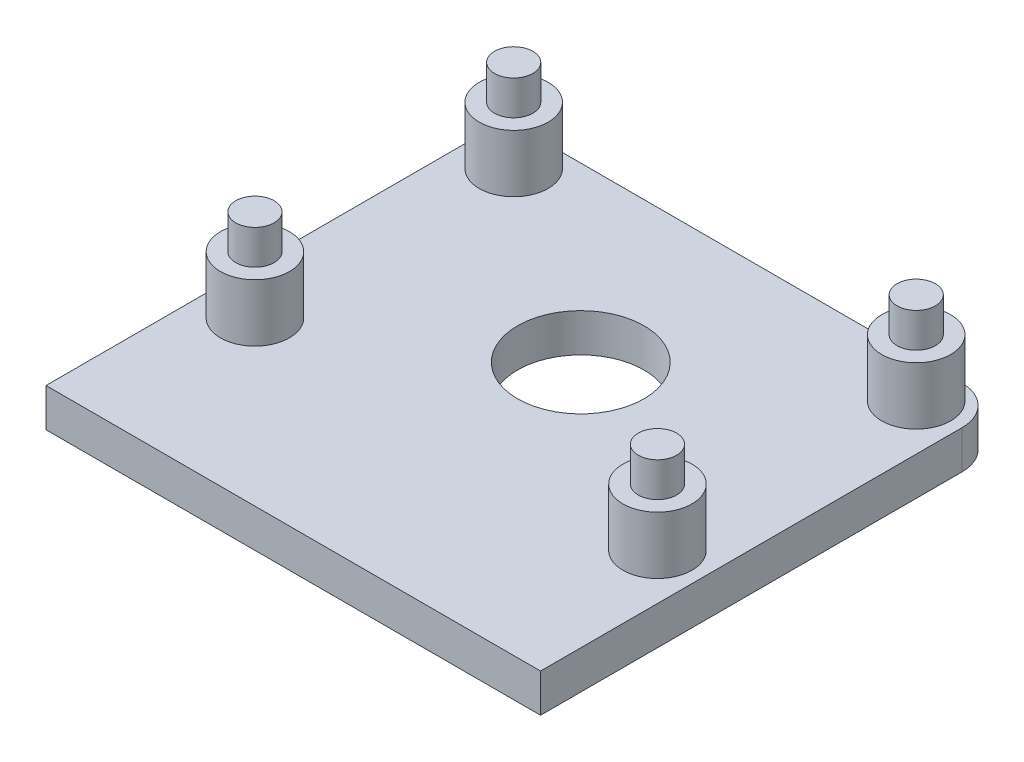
from build123d import *

# Parameters (mm, degrees)
SKETCH_1_W      = 25.8
SKETCH_1_H      = 24
SKETCH_1_R      = 3.3
EXTRUDE_1_DEPTH = 2
SKETCH_2_R      = 1
EXTRUDE_2_DEPTH = 4.8
FILLET_1_R      = 2
SKETCH_3_R      = 1.8
EXTRUDE_3_DEPTH = 3


with BuildPart() as part:
    # Sketch 1 → Extrude 1 (new body)
    with BuildSketch(Plane(origin=(0, 0, 0), x_dir=(1, 0, 0), z_dir=(0, 1, 0))):
        with Locations((-0.970485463, 3.121778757)):
            Rectangle(SKETCH_1_W, SKETCH_1_H)
        with Locations(Location((-0.970485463, 6.121778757, 0), (0, 0, 270))):
            Circle(SKETCH_1_R, mode=Mode.SUBTRACT)
    extrude(amount=EXTRUDE_1_DEPTH)

    # Sketch 2 → Extrude 2 (add)
    with BuildSketch(Plane(origin=(0, 2, 0), x_dir=(1, 0, 0), z_dir=(0, 1, 0))):
        with Locations(Location((-11.470485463, 13.121778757, 0), (0, 0, 270))):
            Circle(SKETCH_2_R)
        with Locations(Location((9.529514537, 13.121778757, 0), (0, 0, 270))):
            Circle(SKETCH_2_R)
        with Locations(Location((-11.470485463, -0.378221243, 0), (0, 0, 270))):
            Circle(SKETCH_2_R)
        with Locations(Location((9.529514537, -0.378221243, 0), (0, 0, 270))):
            Circle(SKETCH_2_R)
    extrude(amount=EXTRUDE_2_DEPTH)

    # Fillet 1
    fillet_1_edges = [part.edges().sort_by_distance(p)[0] for p in [
        (-13.870485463, 1, -15.121778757),
        (11.929514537, 1, -15.121778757),
    ]]
    fillet(fillet_1_edges, radius=FILLET_1_R)

    # Sketch 3 → Extrude 3 (add)
    with BuildSketch(Plane(origin=(0, 2, 0), x_dir=(1, 0, 0), z_dir=(0, 1, 0))):
        with Locations(Location((-11.470485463, 13.121778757, 0), (0, 0, 270))):
            Circle(SKETCH_3_R)
        with Locations(Location((9.529514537, 13.121778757, 0), (0, 0, 270))):
            Circle(SKETCH_3_R)
        with Locations(Location((-11.470485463, -0.378221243, 0), (0, 0, 270))):
            Circle(SKETCH_3_R)
        with Locations(Location((9.529514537, -0.378221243, 0), (0, 0, 270))):
            Circle(SKETCH_3_R)
    extrude(amount=EXTRUDE_3_DEPTH)


solid = part.part
